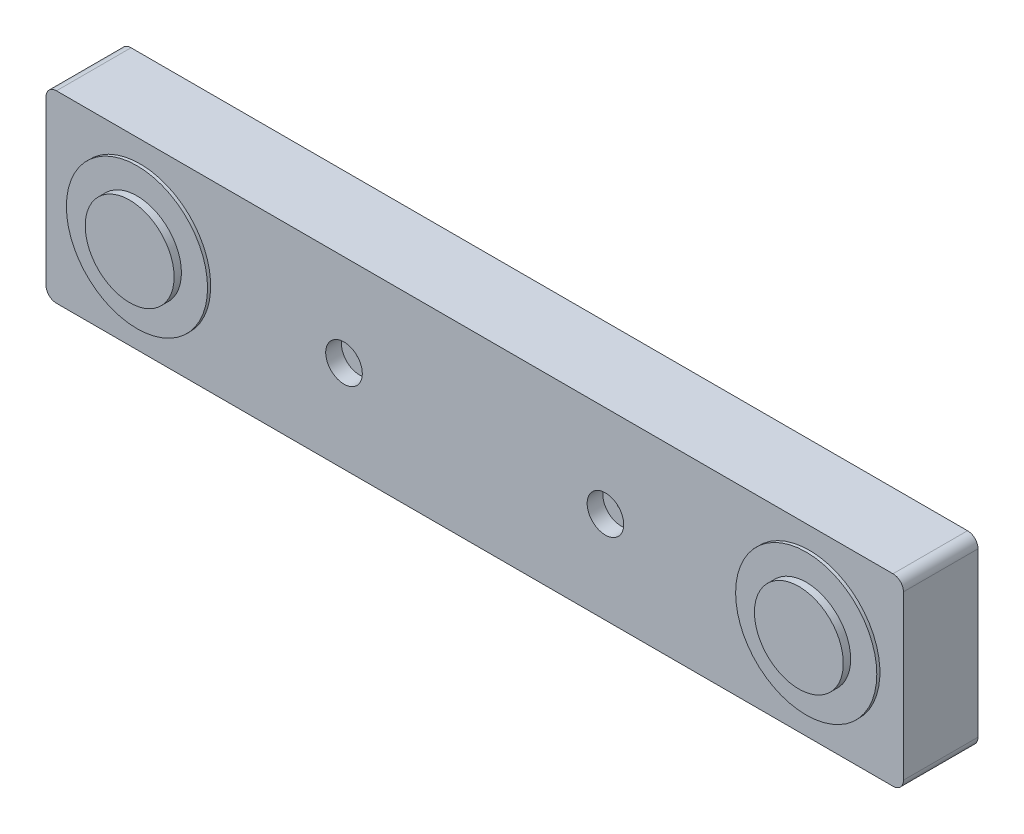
ISO-10303-21;
HEADER;
FILE_DESCRIPTION(('STEP AP214'),'2;1');
FILE_NAME('part.step','',(''),(''),'','','');
FILE_SCHEMA(('AUTOMOTIVE_DESIGN { 1 0 10303 214 1 1 1 1 }'));
ENDSEC;
DATA;
#1=APPLICATION_CONTEXT('core data for automotive mechanical design processes');
#2=APPLICATION_PROTOCOL_DEFINITION('international standard','automotive_design',2000,#1);
#3=PRODUCT_CONTEXT('',#1,'mechanical');
#4=PRODUCT('Part','Part','',(#3));
#5=PRODUCT_RELATED_PRODUCT_CATEGORY('part','',(#4));
#6=PRODUCT_DEFINITION_FORMATION('','',#4);
#7=PRODUCT_DEFINITION_CONTEXT('part definition',#1,'design');
#8=PRODUCT_DEFINITION('design','',#6,#7);
#9=PRODUCT_DEFINITION_SHAPE('','',#8);
#10=(LENGTH_UNIT() NAMED_UNIT(*) SI_UNIT(.MILLI.,.METRE.));
#11=(NAMED_UNIT(*) PLANE_ANGLE_UNIT() SI_UNIT($,.RADIAN.));
#12=(NAMED_UNIT(*) SI_UNIT($,.STERADIAN.) SOLID_ANGLE_UNIT());
#13=UNCERTAINTY_MEASURE_WITH_UNIT(LENGTH_MEASURE(1.E-05),#10,'distance_accuracy_value','');
#14=(GEOMETRIC_REPRESENTATION_CONTEXT(3) GLOBAL_UNCERTAINTY_ASSIGNED_CONTEXT((#13)) GLOBAL_UNIT_ASSIGNED_CONTEXT((#10,
#11,#12)) REPRESENTATION_CONTEXT('',''));
#15=CARTESIAN_POINT('',(0.,0.,0.));
#16=DIRECTION('',(0.,0.,1.));
#17=DIRECTION('',(1.,0.,0.));
#18=AXIS2_PLACEMENT_3D('',#15,#16,#17);
#19=CARTESIAN_POINT('',(64.85,8.8,0.));
#20=DIRECTION('',(0.,0.,1.));
#21=DIRECTION('',(1.,0.,0.));
#22=AXIS2_PLACEMENT_3D('',#19,#20,#21);
#23=CYLINDRICAL_SURFACE('',#22,0.400000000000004);
#24=CARTESIAN_POINT('',(64.85,8.8,0.));
#25=DIRECTION('',(0.,0.,1.));
#26=DIRECTION('',(-1.,0.,0.));
#27=AXIS2_PLACEMENT_3D('',#24,#25,#26);
#28=CIRCLE('',#27,0.400000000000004);
#29=CARTESIAN_POINT('',(64.45,8.8,0.));
#30=VERTEX_POINT('',#29);
#31=EDGE_CURVE('E173',#30,#30,#28,.T.);
#32=ORIENTED_EDGE('',*,*,#31,.F.);
#33=EDGE_LOOP('',(#32));
#34=FACE_BOUND('',#33,.T.);
#35=CARTESIAN_POINT('',(64.85,8.8,5.63));
#36=DIRECTION('',(0.,0.,1.));
#37=DIRECTION('',(1.,0.,0.));
#38=AXIS2_PLACEMENT_3D('',#35,#36,#37);
#39=CIRCLE('',#38,0.400000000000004);
#40=CARTESIAN_POINT('',(65.25,8.8,5.63));
#41=VERTEX_POINT('',#40);
#42=EDGE_CURVE('E169',#41,#41,#39,.F.);
#43=ORIENTED_EDGE('',*,*,#42,.F.);
#44=EDGE_LOOP('',(#43));
#45=FACE_BOUND('',#44,.T.);
#46=ADVANCED_FACE('F36',(#34,#45),#23,.F.);
#47=CARTESIAN_POINT('',(39.85,8.79999999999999,0.));
#48=DIRECTION('',(0.,0.,1.));
#49=DIRECTION('',(1.,0.,0.));
#50=AXIS2_PLACEMENT_3D('',#47,#48,#49);
#51=CYLINDRICAL_SURFACE('',#50,0.399999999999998);
#52=CARTESIAN_POINT('',(39.85,8.79999999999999,0.));
#53=DIRECTION('',(0.,0.,1.));
#54=DIRECTION('',(1.,0.,0.));
#55=AXIS2_PLACEMENT_3D('',#52,#53,#54);
#56=CIRCLE('',#55,0.399999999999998);
#57=CARTESIAN_POINT('',(40.25,8.79999999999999,0.));
#58=VERTEX_POINT('',#57);
#59=EDGE_CURVE('E135',#58,#58,#56,.T.);
#60=ORIENTED_EDGE('',*,*,#59,.F.);
#61=EDGE_LOOP('',(#60));
#62=FACE_BOUND('',#61,.T.);
#63=CARTESIAN_POINT('',(39.85,8.79999999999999,5.63));
#64=DIRECTION('',(0.,0.,1.));
#65=DIRECTION('',(1.,0.,0.));
#66=AXIS2_PLACEMENT_3D('',#63,#64,#65);
#67=CIRCLE('',#66,0.399999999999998);
#68=CARTESIAN_POINT('',(40.25,8.79999999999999,5.63));
#69=VERTEX_POINT('',#68);
#70=EDGE_CURVE('E166',#69,#69,#67,.F.);
#71=ORIENTED_EDGE('',*,*,#70,.F.);
#72=EDGE_LOOP('',(#71));
#73=FACE_BOUND('',#72,.T.);
#74=ADVANCED_FACE('F246',(#62,#73),#51,.F.);
#75=CARTESIAN_POINT('',(93.35,17.6,7.13));
#76=DIRECTION('',(-1.,0.,0.));
#77=DIRECTION('',(0.,0.,1.));
#78=AXIS2_PLACEMENT_3D('',#75,#76,#77);
#79=PLANE('',#78);
#80=DIRECTION('',(0.,1.,0.));
#81=VECTOR('',#80,1.);
#82=CARTESIAN_POINT('',(93.35,17.6,0.));
#83=LINE('',#82,#81);
#84=CARTESIAN_POINT('',(93.35,1.,0.));
#85=VERTEX_POINT('',#84);
#86=CARTESIAN_POINT('',(93.35,16.6,0.));
#87=VERTEX_POINT('',#86);
#88=EDGE_CURVE('E130',#85,#87,#83,.T.);
#89=ORIENTED_EDGE('',*,*,#88,.T.);
#90=DIRECTION('',(0.,0.,-1.));
#91=VECTOR('',#90,1.);
#92=CARTESIAN_POINT('',(93.35,16.6,7.13));
#93=LINE('',#92,#91);
#94=CARTESIAN_POINT('',(93.35,16.6,7.13));
#95=VERTEX_POINT('',#94);
#96=EDGE_CURVE('E108',#87,#95,#93,.F.);
#97=ORIENTED_EDGE('',*,*,#96,.T.);
#98=DIRECTION('',(0.,1.,0.));
#99=VECTOR('',#98,1.);
#100=CARTESIAN_POINT('',(93.35,17.6,7.13));
#101=LINE('',#100,#99);
#102=CARTESIAN_POINT('',(93.35,1.,7.13));
#103=VERTEX_POINT('',#102);
#104=EDGE_CURVE('E140',#103,#95,#101,.T.);
#105=ORIENTED_EDGE('',*,*,#104,.F.);
#106=DIRECTION('',(0.,0.,-1.));
#107=VECTOR('',#106,1.);
#108=CARTESIAN_POINT('',(93.35,1.,7.13));
#109=LINE('',#108,#107);
#110=EDGE_CURVE('E113',#103,#85,#109,.T.);
#111=ORIENTED_EDGE('',*,*,#110,.T.);
#112=EDGE_LOOP('',(#89,#97,#105,#111));
#113=FACE_BOUND('',#112,.T.);
#114=ADVANCED_FACE('F224',(#113),#79,.F.);
#115=CARTESIAN_POINT('',(93.35,17.6,7.13));
#116=DIRECTION('',(0.,-1.,0.));
#117=DIRECTION('',(1.,0.,0.));
#118=AXIS2_PLACEMENT_3D('',#115,#116,#117);
#119=PLANE('',#118);
#120=DIRECTION('',(-1.,0.,0.));
#121=VECTOR('',#120,1.);
#122=CARTESIAN_POINT('',(93.35,17.6,7.13));
#123=LINE('',#122,#121);
#124=CARTESIAN_POINT('',(92.35,17.6,7.13));
#125=VERTEX_POINT('',#124);
#126=CARTESIAN_POINT('',(12.35,17.6,7.13));
#127=VERTEX_POINT('',#126);
#128=EDGE_CURVE('E123',#125,#127,#123,.T.);
#129=ORIENTED_EDGE('',*,*,#128,.F.);
#130=DIRECTION('',(0.,0.,-1.));
#131=VECTOR('',#130,1.);
#132=CARTESIAN_POINT('',(92.35,17.6,7.13));
#133=LINE('',#132,#131);
#134=CARTESIAN_POINT('',(92.35,17.6,0.));
#135=VERTEX_POINT('',#134);
#136=EDGE_CURVE('E107',#125,#135,#133,.T.);
#137=ORIENTED_EDGE('',*,*,#136,.T.);
#138=DIRECTION('',(-1.,0.,0.));
#139=VECTOR('',#138,1.);
#140=CARTESIAN_POINT('',(93.35,17.6,0.));
#141=LINE('',#140,#139);
#142=CARTESIAN_POINT('',(12.35,17.6,0.));
#143=VERTEX_POINT('',#142);
#144=EDGE_CURVE('E120',#135,#143,#141,.T.);
#145=ORIENTED_EDGE('',*,*,#144,.T.);
#146=DIRECTION('',(0.,0.,-1.));
#147=VECTOR('',#146,1.);
#148=CARTESIAN_POINT('',(12.35,17.6,7.13));
#149=LINE('',#148,#147);
#150=EDGE_CURVE('E125',#143,#127,#149,.F.);
#151=ORIENTED_EDGE('',*,*,#150,.T.);
#152=EDGE_LOOP('',(#129,#137,#145,#151));
#153=FACE_BOUND('',#152,.T.);
#154=ADVANCED_FACE('F119',(#153),#119,.F.);
#155=CARTESIAN_POINT('',(11.35,17.6,7.13));
#156=DIRECTION('',(1.,0.,0.));
#157=DIRECTION('',(0.,1.,0.));
#158=AXIS2_PLACEMENT_3D('',#155,#156,#157);
#159=PLANE('',#158);
#160=DIRECTION('',(0.,-1.,0.));
#161=VECTOR('',#160,1.);
#162=CARTESIAN_POINT('',(11.35,17.6,0.));
#163=LINE('',#162,#161);
#164=CARTESIAN_POINT('',(11.35,16.6,0.));
#165=VERTEX_POINT('',#164);
#166=CARTESIAN_POINT('',(11.35,1.,0.));
#167=VERTEX_POINT('',#166);
#168=EDGE_CURVE('E129',#165,#167,#163,.T.);
#169=ORIENTED_EDGE('',*,*,#168,.T.);
#170=DIRECTION('',(0.,0.,-1.));
#171=VECTOR('',#170,1.);
#172=CARTESIAN_POINT('',(11.35,1.,7.13));
#173=LINE('',#172,#171);
#174=CARTESIAN_POINT('',(11.35,1.,7.13));
#175=VERTEX_POINT('',#174);
#176=EDGE_CURVE('E164',#167,#175,#173,.F.);
#177=ORIENTED_EDGE('',*,*,#176,.T.);
#178=DIRECTION('',(0.,-1.,0.));
#179=VECTOR('',#178,1.);
#180=CARTESIAN_POINT('',(11.35,17.6,7.13));
#181=LINE('',#180,#179);
#182=CARTESIAN_POINT('',(11.35,16.6,7.13));
#183=VERTEX_POINT('',#182);
#184=EDGE_CURVE('E215',#183,#175,#181,.T.);
#185=ORIENTED_EDGE('',*,*,#184,.F.);
#186=DIRECTION('',(0.,0.,-1.));
#187=VECTOR('',#186,1.);
#188=CARTESIAN_POINT('',(11.35,16.6,7.13));
#189=LINE('',#188,#187);
#190=EDGE_CURVE('E161',#183,#165,#189,.T.);
#191=ORIENTED_EDGE('',*,*,#190,.T.);
#192=EDGE_LOOP('',(#169,#177,#185,#191));
#193=FACE_BOUND('',#192,.T.);
#194=ADVANCED_FACE('F231',(#193),#159,.F.);
#195=CARTESIAN_POINT('',(93.35,0.,7.13));
#196=DIRECTION('',(0.,1.,0.));
#197=DIRECTION('',(0.,0.,1.));
#198=AXIS2_PLACEMENT_3D('',#195,#196,#197);
#199=PLANE('',#198);
#200=DIRECTION('',(1.,0.,0.));
#201=VECTOR('',#200,1.);
#202=CARTESIAN_POINT('',(93.35,0.,0.));
#203=LINE('',#202,#201);
#204=CARTESIAN_POINT('',(12.35,0.,0.));
#205=VERTEX_POINT('',#204);
#206=CARTESIAN_POINT('',(92.35,0.,0.));
#207=VERTEX_POINT('',#206);
#208=EDGE_CURVE('E133',#205,#207,#203,.T.);
#209=ORIENTED_EDGE('',*,*,#208,.T.);
#210=DIRECTION('',(0.,0.,-1.));
#211=VECTOR('',#210,1.);
#212=CARTESIAN_POINT('',(92.35,0.,7.13));
#213=LINE('',#212,#211);
#214=CARTESIAN_POINT('',(92.35,0.,7.13));
#215=VERTEX_POINT('',#214);
#216=EDGE_CURVE('E51',#207,#215,#213,.F.);
#217=ORIENTED_EDGE('',*,*,#216,.T.);
#218=DIRECTION('',(1.,0.,0.));
#219=VECTOR('',#218,1.);
#220=CARTESIAN_POINT('',(93.35,0.,7.13));
#221=LINE('',#220,#219);
#222=CARTESIAN_POINT('',(12.35,0.,7.13));
#223=VERTEX_POINT('',#222);
#224=EDGE_CURVE('E141',#223,#215,#221,.T.);
#225=ORIENTED_EDGE('',*,*,#224,.F.);
#226=DIRECTION('',(0.,0.,-1.));
#227=VECTOR('',#226,1.);
#228=CARTESIAN_POINT('',(12.35,0.,7.13));
#229=LINE('',#228,#227);
#230=EDGE_CURVE('E157',#223,#205,#229,.T.);
#231=ORIENTED_EDGE('',*,*,#230,.T.);
#232=EDGE_LOOP('',(#209,#217,#225,#231));
#233=FACE_BOUND('',#232,.T.);
#234=ADVANCED_FACE('F226',(#233),#199,.F.);
#235=CARTESIAN_POINT('',(0.,0.,7.13));
#236=DIRECTION('',(0.,0.,-1.));
#237=DIRECTION('',(-1.,0.,0.));
#238=AXIS2_PLACEMENT_3D('',#235,#236,#237);
#239=PLANE('',#238);
#240=CARTESIAN_POINT('',(84.35,8.80000000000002,7.13));
#241=DIRECTION('',(0.,0.,-1.));
#242=DIRECTION('',(-1.,0.,0.));
#243=AXIS2_PLACEMENT_3D('',#240,#241,#242);
#244=CIRCLE('',#243,6.75);
#245=CARTESIAN_POINT('',(77.6,8.80000000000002,7.13));
#246=VERTEX_POINT('',#245);
#247=EDGE_CURVE('E11',#246,#246,#244,.F.);
#248=ORIENTED_EDGE('',*,*,#247,.F.);
#249=EDGE_LOOP('',(#248));
#250=FACE_BOUND('',#249,.T.);
#251=CARTESIAN_POINT('',(20.35,8.8,7.13));
#252=DIRECTION('',(0.,0.,-1.));
#253=DIRECTION('',(-1.,0.,0.));
#254=AXIS2_PLACEMENT_3D('',#251,#252,#253);
#255=CIRCLE('',#254,6.75);
#256=CARTESIAN_POINT('',(13.6,8.8,7.13));
#257=VERTEX_POINT('',#256);
#258=EDGE_CURVE('E44',#257,#257,#255,.F.);
#259=ORIENTED_EDGE('',*,*,#258,.F.);
#260=EDGE_LOOP('',(#259));
#261=FACE_BOUND('',#260,.T.);
#262=CARTESIAN_POINT('',(39.85,8.79999999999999,7.13));
#263=DIRECTION('',(0.,0.,1.));
#264=DIRECTION('',(1.,0.,0.));
#265=AXIS2_PLACEMENT_3D('',#262,#263,#264);
#266=CIRCLE('',#265,1.75);
#267=CARTESIAN_POINT('',(41.6,8.79999999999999,7.13));
#268=VERTEX_POINT('',#267);
#269=EDGE_CURVE('E200',#268,#268,#266,.T.);
#270=ORIENTED_EDGE('',*,*,#269,.F.);
#271=EDGE_LOOP('',(#270));
#272=FACE_BOUND('',#271,.T.);
#273=CARTESIAN_POINT('',(64.85,8.8,7.13));
#274=DIRECTION('',(0.,0.,1.));
#275=DIRECTION('',(1.,0.,0.));
#276=AXIS2_PLACEMENT_3D('',#273,#274,#275);
#277=CIRCLE('',#276,1.75);
#278=CARTESIAN_POINT('',(66.6,8.8,7.13));
#279=VERTEX_POINT('',#278);
#280=EDGE_CURVE('E197',#279,#279,#277,.T.);
#281=ORIENTED_EDGE('',*,*,#280,.F.);
#282=EDGE_LOOP('',(#281));
#283=FACE_BOUND('',#282,.T.);
#284=ORIENTED_EDGE('',*,*,#104,.T.);
#285=CARTESIAN_POINT('',(92.35,16.6,7.13));
#286=DIRECTION('',(0.,0.,-1.));
#287=DIRECTION('',(-1.,0.,0.));
#288=AXIS2_PLACEMENT_3D('',#285,#286,#287);
#289=CIRCLE('',#288,1.);
#290=EDGE_CURVE('E155',#95,#125,#289,.F.);
#291=ORIENTED_EDGE('',*,*,#290,.T.);
#292=ORIENTED_EDGE('',*,*,#128,.T.);
#293=CARTESIAN_POINT('',(12.35,16.6,7.13));
#294=DIRECTION('',(0.,0.,-1.));
#295=DIRECTION('',(-1.,0.,0.));
#296=AXIS2_PLACEMENT_3D('',#293,#294,#295);
#297=CIRCLE('',#296,1.);
#298=EDGE_CURVE('E150',#127,#183,#297,.F.);
#299=ORIENTED_EDGE('',*,*,#298,.T.);
#300=ORIENTED_EDGE('',*,*,#184,.T.);
#301=CARTESIAN_POINT('',(12.35,1.,7.13));
#302=DIRECTION('',(0.,0.,-1.));
#303=DIRECTION('',(-1.,0.,0.));
#304=AXIS2_PLACEMENT_3D('',#301,#302,#303);
#305=CIRCLE('',#304,1.);
#306=EDGE_CURVE('E58',#175,#223,#305,.F.);
#307=ORIENTED_EDGE('',*,*,#306,.T.);
#308=ORIENTED_EDGE('',*,*,#224,.T.);
#309=CARTESIAN_POINT('',(92.35,1.,7.13));
#310=DIRECTION('',(0.,0.,-1.));
#311=DIRECTION('',(-1.,0.,0.));
#312=AXIS2_PLACEMENT_3D('',#309,#310,#311);
#313=CIRCLE('',#312,1.);
#314=EDGE_CURVE('E153',#215,#103,#313,.F.);
#315=ORIENTED_EDGE('',*,*,#314,.T.);
#316=EDGE_LOOP('',(#284,#291,#292,#299,#300,#307,#308,#315));
#317=FACE_BOUND('',#316,.T.);
#318=ADVANCED_FACE('F217',(#250,#261,#272,#283,#317),#239,.F.);
#319=CARTESIAN_POINT('',(0.,0.,0.));
#320=DIRECTION('',(0.,0.,-1.));
#321=DIRECTION('',(-1.,0.,0.));
#322=AXIS2_PLACEMENT_3D('',#319,#320,#321);
#323=PLANE('',#322);
#324=ORIENTED_EDGE('',*,*,#59,.T.);
#325=EDGE_LOOP('',(#324));
#326=FACE_BOUND('',#325,.T.);
#327=ORIENTED_EDGE('',*,*,#31,.T.);
#328=EDGE_LOOP('',(#327));
#329=FACE_BOUND('',#328,.T.);
#330=ORIENTED_EDGE('',*,*,#144,.F.);
#331=CARTESIAN_POINT('',(92.35,16.6,0.));
#332=DIRECTION('',(0.,0.,-1.));
#333=DIRECTION('',(-1.,0.,0.));
#334=AXIS2_PLACEMENT_3D('',#331,#332,#333);
#335=CIRCLE('',#334,1.);
#336=EDGE_CURVE('E103',#135,#87,#335,.T.);
#337=ORIENTED_EDGE('',*,*,#336,.T.);
#338=ORIENTED_EDGE('',*,*,#88,.F.);
#339=CARTESIAN_POINT('',(92.35,1.,0.));
#340=DIRECTION('',(0.,0.,-1.));
#341=DIRECTION('',(-1.,0.,0.));
#342=AXIS2_PLACEMENT_3D('',#339,#340,#341);
#343=CIRCLE('',#342,1.);
#344=EDGE_CURVE('E114',#85,#207,#343,.T.);
#345=ORIENTED_EDGE('',*,*,#344,.T.);
#346=ORIENTED_EDGE('',*,*,#208,.F.);
#347=CARTESIAN_POINT('',(12.35,1.,0.));
#348=DIRECTION('',(0.,0.,-1.));
#349=DIRECTION('',(-1.,0.,0.));
#350=AXIS2_PLACEMENT_3D('',#347,#348,#349);
#351=CIRCLE('',#350,1.);
#352=EDGE_CURVE('E144',#205,#167,#351,.T.);
#353=ORIENTED_EDGE('',*,*,#352,.T.);
#354=ORIENTED_EDGE('',*,*,#168,.F.);
#355=CARTESIAN_POINT('',(12.35,16.6,0.));
#356=DIRECTION('',(0.,0.,-1.));
#357=DIRECTION('',(-1.,0.,0.));
#358=AXIS2_PLACEMENT_3D('',#355,#356,#357);
#359=CIRCLE('',#358,1.);
#360=EDGE_CURVE('E124',#165,#143,#359,.T.);
#361=ORIENTED_EDGE('',*,*,#360,.T.);
#362=EDGE_LOOP('',(#330,#337,#338,#345,#346,#353,#354,#361));
#363=FACE_BOUND('',#362,.T.);
#364=ADVANCED_FACE('F127',(#326,#329,#363),#323,.T.);
#365=CARTESIAN_POINT('',(92.35,16.6,7.13));
#366=DIRECTION('',(0.,0.,-1.));
#367=DIRECTION('',(-1.,0.,0.));
#368=AXIS2_PLACEMENT_3D('',#365,#366,#367);
#369=CYLINDRICAL_SURFACE('',#368,1.);
#370=ORIENTED_EDGE('',*,*,#290,.F.);
#371=ORIENTED_EDGE('',*,*,#96,.F.);
#372=ORIENTED_EDGE('',*,*,#336,.F.);
#373=ORIENTED_EDGE('',*,*,#136,.F.);
#374=EDGE_LOOP('',(#370,#371,#372,#373));
#375=FACE_BOUND('',#374,.T.);
#376=ADVANCED_FACE('F106',(#375),#369,.T.);
#377=CARTESIAN_POINT('',(92.35,1.,7.13));
#378=DIRECTION('',(0.,0.,-1.));
#379=DIRECTION('',(-1.,0.,0.));
#380=AXIS2_PLACEMENT_3D('',#377,#378,#379);
#381=CYLINDRICAL_SURFACE('',#380,1.);
#382=ORIENTED_EDGE('',*,*,#314,.F.);
#383=ORIENTED_EDGE('',*,*,#216,.F.);
#384=ORIENTED_EDGE('',*,*,#344,.F.);
#385=ORIENTED_EDGE('',*,*,#110,.F.);
#386=EDGE_LOOP('',(#382,#383,#384,#385));
#387=FACE_BOUND('',#386,.T.);
#388=ADVANCED_FACE('F222',(#387),#381,.T.);
#389=CARTESIAN_POINT('',(12.35,1.,7.13));
#390=DIRECTION('',(0.,0.,-1.));
#391=DIRECTION('',(-1.,0.,0.));
#392=AXIS2_PLACEMENT_3D('',#389,#390,#391);
#393=CYLINDRICAL_SURFACE('',#392,1.);
#394=ORIENTED_EDGE('',*,*,#306,.F.);
#395=ORIENTED_EDGE('',*,*,#176,.F.);
#396=ORIENTED_EDGE('',*,*,#352,.F.);
#397=ORIENTED_EDGE('',*,*,#230,.F.);
#398=EDGE_LOOP('',(#394,#395,#396,#397));
#399=FACE_BOUND('',#398,.T.);
#400=ADVANCED_FACE('F228',(#399),#393,.T.);
#401=CARTESIAN_POINT('',(12.35,16.6,7.13));
#402=DIRECTION('',(0.,0.,-1.));
#403=DIRECTION('',(-1.,0.,0.));
#404=AXIS2_PLACEMENT_3D('',#401,#402,#403);
#405=CYLINDRICAL_SURFACE('',#404,1.);
#406=ORIENTED_EDGE('',*,*,#298,.F.);
#407=ORIENTED_EDGE('',*,*,#150,.F.);
#408=ORIENTED_EDGE('',*,*,#360,.F.);
#409=ORIENTED_EDGE('',*,*,#190,.F.);
#410=EDGE_LOOP('',(#406,#407,#408,#409));
#411=FACE_BOUND('',#410,.T.);
#412=ADVANCED_FACE('F38',(#411),#405,.T.);
#413=CARTESIAN_POINT('',(39.85,8.79999999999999,5.63));
#414=DIRECTION('',(0.,0.,1.));
#415=DIRECTION('',(1.,0.,0.));
#416=AXIS2_PLACEMENT_3D('',#413,#414,#415);
#417=PLANE('',#416);
#418=CARTESIAN_POINT('',(39.85,8.79999999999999,5.63));
#419=DIRECTION('',(0.,0.,1.));
#420=DIRECTION('',(1.,0.,0.));
#421=AXIS2_PLACEMENT_3D('',#418,#419,#420);
#422=CIRCLE('',#421,1.75);
#423=CARTESIAN_POINT('',(41.6,8.79999999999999,5.63));
#424=VERTEX_POINT('',#423);
#425=EDGE_CURVE('E170',#424,#424,#422,.T.);
#426=ORIENTED_EDGE('',*,*,#425,.T.);
#427=EDGE_LOOP('',(#426));
#428=FACE_BOUND('',#427,.T.);
#429=ORIENTED_EDGE('',*,*,#70,.T.);
#430=EDGE_LOOP('',(#429));
#431=FACE_BOUND('',#430,.T.);
#432=ADVANCED_FACE('F237',(#428,#431),#417,.T.);
#433=CARTESIAN_POINT('',(39.85,8.79999999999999,5.63));
#434=DIRECTION('',(0.,0.,1.));
#435=DIRECTION('',(1.,0.,0.));
#436=AXIS2_PLACEMENT_3D('',#433,#434,#435);
#437=CYLINDRICAL_SURFACE('',#436,1.75);
#438=ORIENTED_EDGE('',*,*,#425,.F.);
#439=EDGE_LOOP('',(#438));
#440=FACE_BOUND('',#439,.T.);
#441=ORIENTED_EDGE('',*,*,#269,.T.);
#442=EDGE_LOOP('',(#441));
#443=FACE_BOUND('',#442,.T.);
#444=ADVANCED_FACE('F242',(#440,#443),#437,.F.);
#445=CARTESIAN_POINT('',(64.85,8.8,5.63));
#446=DIRECTION('',(0.,0.,1.));
#447=DIRECTION('',(1.,0.,0.));
#448=AXIS2_PLACEMENT_3D('',#445,#446,#447);
#449=PLANE('',#448);
#450=CARTESIAN_POINT('',(64.85,8.8,5.63));
#451=DIRECTION('',(0.,0.,1.));
#452=DIRECTION('',(1.,0.,0.));
#453=AXIS2_PLACEMENT_3D('',#450,#451,#452);
#454=CIRCLE('',#453,1.75);
#455=CARTESIAN_POINT('',(66.6,8.8,5.63));
#456=VERTEX_POINT('',#455);
#457=EDGE_CURVE('E203',#456,#456,#454,.T.);
#458=ORIENTED_EDGE('',*,*,#457,.T.);
#459=EDGE_LOOP('',(#458));
#460=FACE_BOUND('',#459,.T.);
#461=ORIENTED_EDGE('',*,*,#42,.T.);
#462=EDGE_LOOP('',(#461));
#463=FACE_BOUND('',#462,.T.);
#464=ADVANCED_FACE('F320',(#460,#463),#449,.T.);
#465=CARTESIAN_POINT('',(64.85,8.8,5.63));
#466=DIRECTION('',(0.,0.,1.));
#467=DIRECTION('',(1.,0.,0.));
#468=AXIS2_PLACEMENT_3D('',#465,#466,#467);
#469=CYLINDRICAL_SURFACE('',#468,1.75);
#470=ORIENTED_EDGE('',*,*,#457,.F.);
#471=EDGE_LOOP('',(#470));
#472=FACE_BOUND('',#471,.T.);
#473=ORIENTED_EDGE('',*,*,#280,.T.);
#474=EDGE_LOOP('',(#473));
#475=FACE_BOUND('',#474,.T.);
#476=ADVANCED_FACE('F330',(#472,#475),#469,.F.);
#477=CARTESIAN_POINT('',(20.35,8.8,7.43));
#478=DIRECTION('',(0.,0.,-1.));
#479=DIRECTION('',(-1.,0.,0.));
#480=AXIS2_PLACEMENT_3D('',#477,#478,#479);
#481=CYLINDRICAL_SURFACE('',#480,6.75);
#482=CARTESIAN_POINT('',(20.35,8.8,7.43));
#483=DIRECTION('',(0.,0.,1.));
#484=DIRECTION('',(1.,0.,0.));
#485=AXIS2_PLACEMENT_3D('',#482,#483,#484);
#486=CIRCLE('',#485,6.75);
#487=CARTESIAN_POINT('',(27.1,8.8,7.43));
#488=VERTEX_POINT('',#487);
#489=EDGE_CURVE('E178',#488,#488,#486,.T.);
#490=ORIENTED_EDGE('',*,*,#489,.F.);
#491=EDGE_LOOP('',(#490));
#492=FACE_BOUND('',#491,.T.);
#493=ORIENTED_EDGE('',*,*,#258,.T.);
#494=EDGE_LOOP('',(#493));
#495=FACE_BOUND('',#494,.T.);
#496=ADVANCED_FACE('F340',(#492,#495),#481,.T.);
#497=CARTESIAN_POINT('',(20.35,8.8,7.43));
#498=DIRECTION('',(0.,0.,1.));
#499=DIRECTION('',(1.,0.,0.));
#500=AXIS2_PLACEMENT_3D('',#497,#498,#499);
#501=PLANE('',#500);
#502=CARTESIAN_POINT('',(20.35,8.8,7.43));
#503=DIRECTION('',(0.,0.,1.));
#504=DIRECTION('',(1.,0.,0.));
#505=AXIS2_PLACEMENT_3D('',#502,#503,#504);
#506=CIRCLE('',#505,4.25);
#507=CARTESIAN_POINT('',(24.6,8.8,7.43));
#508=VERTEX_POINT('',#507);
#509=EDGE_CURVE('E174',#508,#508,#506,.T.);
#510=ORIENTED_EDGE('',*,*,#509,.F.);
#511=EDGE_LOOP('',(#510));
#512=FACE_BOUND('',#511,.T.);
#513=ORIENTED_EDGE('',*,*,#489,.T.);
#514=EDGE_LOOP('',(#513));
#515=FACE_BOUND('',#514,.T.);
#516=ADVANCED_FACE('F354',(#512,#515),#501,.T.);
#517=CARTESIAN_POINT('',(20.35,8.8,8.13));
#518=DIRECTION('',(0.,0.,1.));
#519=DIRECTION('',(1.,0.,0.));
#520=AXIS2_PLACEMENT_3D('',#517,#518,#519);
#521=PLANE('',#520);
#522=CARTESIAN_POINT('',(20.35,8.8,8.13));
#523=DIRECTION('',(0.,0.,1.));
#524=DIRECTION('',(1.,0.,0.));
#525=AXIS2_PLACEMENT_3D('',#522,#523,#524);
#526=CIRCLE('',#525,4.25);
#527=CARTESIAN_POINT('',(24.6,8.8,8.13));
#528=VERTEX_POINT('',#527);
#529=EDGE_CURVE('E194',#528,#528,#526,.T.);
#530=ORIENTED_EDGE('',*,*,#529,.T.);
#531=EDGE_LOOP('',(#530));
#532=FACE_BOUND('',#531,.T.);
#533=ADVANCED_FACE('F347',(#532),#521,.T.);
#534=CARTESIAN_POINT('',(20.35,8.8,8.13));
#535=DIRECTION('',(0.,0.,-1.));
#536=DIRECTION('',(-1.,0.,0.));
#537=AXIS2_PLACEMENT_3D('',#534,#535,#536);
#538=CYLINDRICAL_SURFACE('',#537,4.25);
#539=ORIENTED_EDGE('',*,*,#509,.T.);
#540=EDGE_LOOP('',(#539));
#541=FACE_BOUND('',#540,.T.);
#542=ORIENTED_EDGE('',*,*,#529,.F.);
#543=EDGE_LOOP('',(#542));
#544=FACE_BOUND('',#543,.T.);
#545=ADVANCED_FACE('F353',(#541,#544),#538,.T.);
#546=CARTESIAN_POINT('',(84.35,8.80000000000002,7.43));
#547=DIRECTION('',(0.,0.,-1.));
#548=DIRECTION('',(-1.,0.,0.));
#549=AXIS2_PLACEMENT_3D('',#546,#547,#548);
#550=CYLINDRICAL_SURFACE('',#549,6.75);
#551=CARTESIAN_POINT('',(84.35,8.80000000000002,7.43));
#552=DIRECTION('',(0.,0.,1.));
#553=DIRECTION('',(1.,0.,0.));
#554=AXIS2_PLACEMENT_3D('',#551,#552,#553);
#555=CIRCLE('',#554,6.75);
#556=CARTESIAN_POINT('',(91.1,8.80000000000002,7.43));
#557=VERTEX_POINT('',#556);
#558=EDGE_CURVE('E182',#557,#557,#555,.T.);
#559=ORIENTED_EDGE('',*,*,#558,.F.);
#560=EDGE_LOOP('',(#559));
#561=FACE_BOUND('',#560,.T.);
#562=ORIENTED_EDGE('',*,*,#247,.T.);
#563=EDGE_LOOP('',(#562));
#564=FACE_BOUND('',#563,.T.);
#565=ADVANCED_FACE('F402',(#561,#564),#550,.T.);
#566=CARTESIAN_POINT('',(84.35,8.80000000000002,7.43));
#567=DIRECTION('',(0.,0.,1.));
#568=DIRECTION('',(1.,0.,0.));
#569=AXIS2_PLACEMENT_3D('',#566,#567,#568);
#570=PLANE('',#569);
#571=CARTESIAN_POINT('',(84.35,8.80000000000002,7.43));
#572=DIRECTION('',(0.,0.,1.));
#573=DIRECTION('',(1.,0.,0.));
#574=AXIS2_PLACEMENT_3D('',#571,#572,#573);
#575=CIRCLE('',#574,4.24999999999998);
#576=CARTESIAN_POINT('',(88.6,8.80000000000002,7.43));
#577=VERTEX_POINT('',#576);
#578=EDGE_CURVE('E180',#577,#577,#575,.T.);
#579=ORIENTED_EDGE('',*,*,#578,.F.);
#580=EDGE_LOOP('',(#579));
#581=FACE_BOUND('',#580,.T.);
#582=ORIENTED_EDGE('',*,*,#558,.T.);
#583=EDGE_LOOP('',(#582));
#584=FACE_BOUND('',#583,.T.);
#585=ADVANCED_FACE('F369',(#581,#584),#570,.T.);
#586=CARTESIAN_POINT('',(84.35,8.80000000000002,8.13));
#587=DIRECTION('',(0.,0.,-1.));
#588=DIRECTION('',(-1.,0.,0.));
#589=AXIS2_PLACEMENT_3D('',#586,#587,#588);
#590=PLANE('',#589);
#591=CARTESIAN_POINT('',(84.35,8.80000000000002,8.13));
#592=DIRECTION('',(0.,0.,1.));
#593=DIRECTION('',(-1.,0.,0.));
#594=AXIS2_PLACEMENT_3D('',#591,#592,#593);
#595=CIRCLE('',#594,4.24999999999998);
#596=CARTESIAN_POINT('',(80.1,8.80000000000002,8.13));
#597=VERTEX_POINT('',#596);
#598=EDGE_CURVE('E177',#597,#597,#595,.T.);
#599=ORIENTED_EDGE('',*,*,#598,.T.);
#600=EDGE_LOOP('',(#599));
#601=FACE_BOUND('',#600,.T.);
#602=ADVANCED_FACE('F363',(#601),#590,.F.);
#603=CARTESIAN_POINT('',(84.35,8.80000000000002,8.13));
#604=DIRECTION('',(0.,0.,-1.));
#605=DIRECTION('',(-1.,0.,0.));
#606=AXIS2_PLACEMENT_3D('',#603,#604,#605);
#607=CYLINDRICAL_SURFACE('',#606,4.24999999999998);
#608=ORIENTED_EDGE('',*,*,#578,.T.);
#609=EDGE_LOOP('',(#608));
#610=FACE_BOUND('',#609,.T.);
#611=ORIENTED_EDGE('',*,*,#598,.F.);
#612=EDGE_LOOP('',(#611));
#613=FACE_BOUND('',#612,.T.);
#614=ADVANCED_FACE('F368',(#610,#613),#607,.T.);
#615=CLOSED_SHELL('',(#46,#74,#114,#154,#194,#234,#318,#364,#376,#388,#400,#412,#432,#444,#464,
#476,#496,#516,#533,#545,#565,#585,#602,#614));
#616=MANIFOLD_SOLID_BREP('B2',#615);
#617=ADVANCED_BREP_SHAPE_REPRESENTATION('',(#18,#616),#14);
#618=SHAPE_DEFINITION_REPRESENTATION(#9,#617);
ENDSEC;
END-ISO-10303-21;
